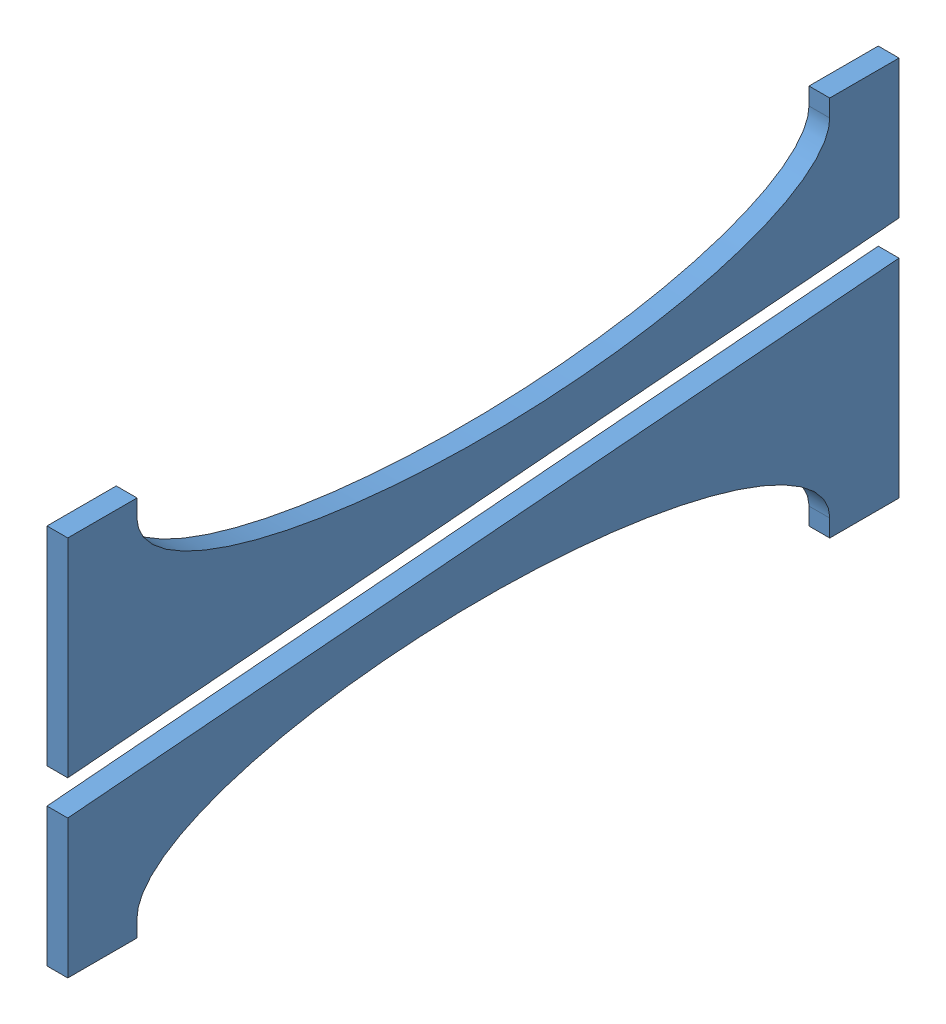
SolidWorks assembly Assemblage1.sldasm, configuration Défaut (file format 8000). Lengths in mm.
Overall size (6 110.03 240).
2 component instances, 1 part files, 3 mates.
Components (placement in the parent):
- THEMA-EQUER-1: THEMA-EQUER.SLDPRT [Défaut] at (-26.7587 -33.2364 360) size (6 60 240)
- THEMA-EQUER-2: THEMA-EQUER.SLDPRT [Défaut] at (-26.7587 76.7983 120) x (1 0 0) z (0 0 -1) size (6 60 240)
Mates (geometry in assembly coordinates):
- Coïncidente1: coincident: plane of THEMA-EQUER-1 through (-26.7587 -28.2364 240) normal (-1 0 0); plane of THEMA-EQUER-2 through (-26.7587 71.7983 240) normal (-1 0 0)
- Distance1: distance = 10 mm: plane of THEMA-EQUER-1 through (-20.7587 6.7636 360) normal (0 0.996546 0.083045); plane of THEMA-EQUER-2 through (-20.7587 36.7983 120) normal (0 -0.996546 -0.083045)
- Coïncidente3: coincident aligned: plane of THEMA-EQUER-1 through (-20.7587 -33.2364 120) normal (0 0 -1); plane of THEMA-EQUER-2 through (-20.7587 36.7983 120) normal (0 0 -1)
